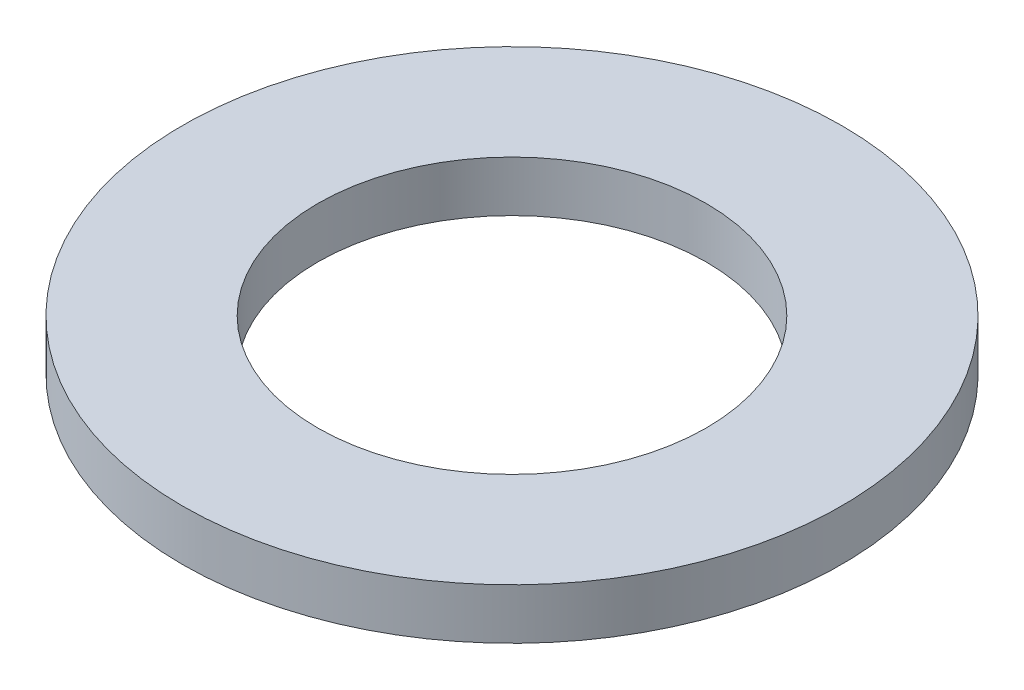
ISO-10303-21;
HEADER;
FILE_DESCRIPTION(('STEP AP214'),'2;1');
FILE_NAME('part.step','',(''),(''),'','','');
FILE_SCHEMA(('AUTOMOTIVE_DESIGN { 1 0 10303 214 1 1 1 1 }'));
ENDSEC;
DATA;
#1=APPLICATION_CONTEXT('core data for automotive mechanical design processes');
#2=APPLICATION_PROTOCOL_DEFINITION('international standard','automotive_design',2000,#1);
#3=PRODUCT_CONTEXT('',#1,'mechanical');
#4=PRODUCT('Part','Part','',(#3));
#5=PRODUCT_RELATED_PRODUCT_CATEGORY('part','',(#4));
#6=PRODUCT_DEFINITION_FORMATION('','',#4);
#7=PRODUCT_DEFINITION_CONTEXT('part definition',#1,'design');
#8=PRODUCT_DEFINITION('design','',#6,#7);
#9=PRODUCT_DEFINITION_SHAPE('','',#8);
#10=(LENGTH_UNIT() NAMED_UNIT(*) SI_UNIT(.MILLI.,.METRE.));
#11=(NAMED_UNIT(*) PLANE_ANGLE_UNIT() SI_UNIT($,.RADIAN.));
#12=(NAMED_UNIT(*) SI_UNIT($,.STERADIAN.) SOLID_ANGLE_UNIT());
#13=UNCERTAINTY_MEASURE_WITH_UNIT(LENGTH_MEASURE(1.E-05),#10,'distance_accuracy_value','');
#14=(GEOMETRIC_REPRESENTATION_CONTEXT(3) GLOBAL_UNCERTAINTY_ASSIGNED_CONTEXT((#13)) GLOBAL_UNIT_ASSIGNED_CONTEXT((#10,
#11,#12)) REPRESENTATION_CONTEXT('',''));
#15=CARTESIAN_POINT('',(0.,0.,0.));
#16=DIRECTION('',(0.,0.,1.));
#17=DIRECTION('',(1.,0.,0.));
#18=AXIS2_PLACEMENT_3D('',#15,#16,#17);
#19=CARTESIAN_POINT('',(0.,3.,0.));
#20=DIRECTION('',(0.,1.,0.));
#21=DIRECTION('',(0.,0.,1.));
#22=AXIS2_PLACEMENT_3D('',#19,#20,#21);
#23=PLANE('',#22);
#24=CARTESIAN_POINT('',(0.,3.,0.));
#25=DIRECTION('',(0.,1.,0.));
#26=DIRECTION('',(0.,0.,1.));
#27=AXIS2_PLACEMENT_3D('',#24,#25,#26);
#28=CIRCLE('',#27,19.5);
#29=CARTESIAN_POINT('',(0.,3.,19.5));
#30=VERTEX_POINT('',#29);
#31=EDGE_CURVE('E10',#30,#30,#28,.T.);
#32=ORIENTED_EDGE('',*,*,#31,.T.);
#33=EDGE_LOOP('',(#32));
#34=FACE_BOUND('',#33,.T.);
#35=CARTESIAN_POINT('',(0.,3.,0.));
#36=DIRECTION('',(0.,1.,0.));
#37=DIRECTION('',(0.,0.,1.));
#38=AXIS2_PLACEMENT_3D('',#35,#36,#37);
#39=CIRCLE('',#38,11.5);
#40=CARTESIAN_POINT('',(0.,3.,11.5));
#41=VERTEX_POINT('',#40);
#42=EDGE_CURVE('E39',#41,#41,#39,.T.);
#43=ORIENTED_EDGE('',*,*,#42,.F.);
#44=EDGE_LOOP('',(#43));
#45=FACE_BOUND('',#44,.T.);
#46=ADVANCED_FACE('F28',(#34,#45),#23,.T.);
#47=CARTESIAN_POINT('',(0.,0.,0.));
#48=DIRECTION('',(0.,1.,0.));
#49=DIRECTION('',(0.,0.,1.));
#50=AXIS2_PLACEMENT_3D('',#47,#48,#49);
#51=PLANE('',#50);
#52=CARTESIAN_POINT('',(0.,0.,0.));
#53=DIRECTION('',(0.,1.,0.));
#54=DIRECTION('',(0.,0.,1.));
#55=AXIS2_PLACEMENT_3D('',#52,#53,#54);
#56=CIRCLE('',#55,19.5);
#57=CARTESIAN_POINT('',(0.,0.,19.5));
#58=VERTEX_POINT('',#57);
#59=EDGE_CURVE('E35',#58,#58,#56,.T.);
#60=ORIENTED_EDGE('',*,*,#59,.F.);
#61=EDGE_LOOP('',(#60));
#62=FACE_BOUND('',#61,.T.);
#63=CARTESIAN_POINT('',(0.,0.,0.));
#64=DIRECTION('',(0.,1.,0.));
#65=DIRECTION('',(0.,0.,1.));
#66=AXIS2_PLACEMENT_3D('',#63,#64,#65);
#67=CIRCLE('',#66,11.5);
#68=CARTESIAN_POINT('',(0.,0.,11.5));
#69=VERTEX_POINT('',#68);
#70=EDGE_CURVE('E43',#69,#69,#67,.T.);
#71=ORIENTED_EDGE('',*,*,#70,.T.);
#72=EDGE_LOOP('',(#71));
#73=FACE_BOUND('',#72,.T.);
#74=ADVANCED_FACE('F49',(#62,#73),#51,.F.);
#75=CARTESIAN_POINT('',(0.,3.,0.));
#76=DIRECTION('',(0.,-1.,0.));
#77=DIRECTION('',(0.,0.,-1.));
#78=AXIS2_PLACEMENT_3D('',#75,#76,#77);
#79=CYLINDRICAL_SURFACE('',#78,19.5);
#80=ORIENTED_EDGE('',*,*,#31,.F.);
#81=EDGE_LOOP('',(#80));
#82=FACE_BOUND('',#81,.T.);
#83=ORIENTED_EDGE('',*,*,#59,.T.);
#84=EDGE_LOOP('',(#83));
#85=FACE_BOUND('',#84,.T.);
#86=ADVANCED_FACE('F30',(#82,#85),#79,.T.);
#87=CARTESIAN_POINT('',(0.,3.,0.));
#88=DIRECTION('',(0.,-1.,0.));
#89=DIRECTION('',(0.,0.,-1.));
#90=AXIS2_PLACEMENT_3D('',#87,#88,#89);
#91=CYLINDRICAL_SURFACE('',#90,11.5);
#92=ORIENTED_EDGE('',*,*,#42,.T.);
#93=EDGE_LOOP('',(#92));
#94=FACE_BOUND('',#93,.T.);
#95=ORIENTED_EDGE('',*,*,#70,.F.);
#96=EDGE_LOOP('',(#95));
#97=FACE_BOUND('',#96,.T.);
#98=ADVANCED_FACE('F51',(#94,#97),#91,.F.);
#99=CLOSED_SHELL('',(#46,#74,#86,#98));
#100=MANIFOLD_SOLID_BREP('B2',#99);
#101=ADVANCED_BREP_SHAPE_REPRESENTATION('',(#18,#100),#14);
#102=SHAPE_DEFINITION_REPRESENTATION(#9,#101);
ENDSEC;
END-ISO-10303-21;
